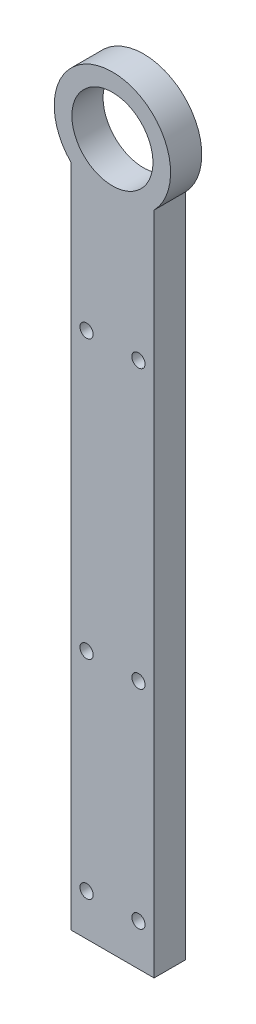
from build123d import *

# Parameters (mm, degrees)
SKETCH1_R           = 12.3825
SKETCH1_R_2         = 2.0193
BOSS_EXTRUDE1_DEPTH = 9.525


with BuildPart() as part:
    # Sketch1 → Boss-Extrude1 (new body)
    with BuildSketch(Plane.XY):
        with BuildLine():
            Line((-12.668384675, -12.475593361), (-12.668384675, -215.611058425))
            Line((-12.668384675, -215.611058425), (12.731615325, -215.611058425))
            Line((12.731615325, -215.611058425), (12.731615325, -12.411058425))
            ThreePointArc((12.731615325, -12.411058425), (-0.04517431, 17.779942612), (-12.668384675, -12.475593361))
        make_face()
        with Locations(Location((0, 0, 0), (0, 0, 180))):
            Circle(SKETCH1_R, mode=Mode.SUBTRACT)
        with Locations(Location((-7.905884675, -54.614193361, 0), (0, 0, 180))):
            Circle(SKETCH1_R_2, mode=Mode.SUBTRACT)
        with Locations(Location((-7.893184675, -202.911058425, 0), (0, 0, 180))):
            Circle(SKETCH1_R_2, mode=Mode.SUBTRACT)
        with Locations(Location((7.956415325, -202.911058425, 0), (0, 0, 180))):
            Circle(SKETCH1_R_2, mode=Mode.SUBTRACT)
        with Locations(Location((7.956415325, -54.549658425, 0), (0, 0, 180))):
            Circle(SKETCH1_R_2, mode=Mode.SUBTRACT)
        with Locations(Location((-7.893184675, -139.411058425, 0), (0, 0, 180))):
            Circle(SKETCH1_R_2, mode=Mode.SUBTRACT)
        with Locations(Location((7.956415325, -139.411058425, 0), (0, 0, 180))):
            Circle(SKETCH1_R_2, mode=Mode.SUBTRACT)
    extrude(amount=BOSS_EXTRUDE1_DEPTH)


solid = part.part
